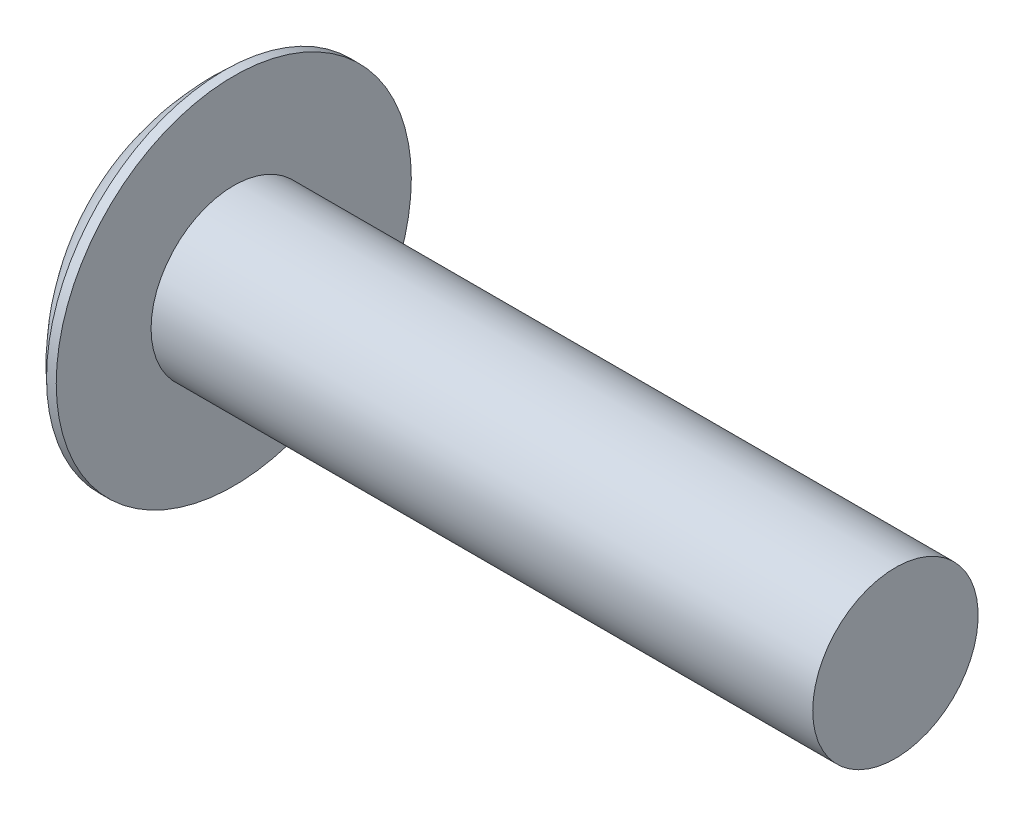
ISO-10303-21;
HEADER;
FILE_DESCRIPTION(('STEP AP214'),'2;1');
FILE_NAME('part.step','',(''),(''),'','','');
FILE_SCHEMA(('AUTOMOTIVE_DESIGN { 1 0 10303 214 1 1 1 1 }'));
ENDSEC;
DATA;
#1=APPLICATION_CONTEXT('core data for automotive mechanical design processes');
#2=APPLICATION_PROTOCOL_DEFINITION('international standard','automotive_design',2000,#1);
#3=PRODUCT_CONTEXT('',#1,'mechanical');
#4=PRODUCT('Part','Part','',(#3));
#5=PRODUCT_RELATED_PRODUCT_CATEGORY('part','',(#4));
#6=PRODUCT_DEFINITION_FORMATION('','',#4);
#7=PRODUCT_DEFINITION_CONTEXT('part definition',#1,'design');
#8=PRODUCT_DEFINITION('design','',#6,#7);
#9=PRODUCT_DEFINITION_SHAPE('','',#8);
#10=(LENGTH_UNIT() NAMED_UNIT(*) SI_UNIT(.MILLI.,.METRE.));
#11=(NAMED_UNIT(*) PLANE_ANGLE_UNIT() SI_UNIT($,.RADIAN.));
#12=(NAMED_UNIT(*) SI_UNIT($,.STERADIAN.) SOLID_ANGLE_UNIT());
#13=UNCERTAINTY_MEASURE_WITH_UNIT(LENGTH_MEASURE(1.E-05),#10,'distance_accuracy_value','');
#14=(GEOMETRIC_REPRESENTATION_CONTEXT(3) GLOBAL_UNCERTAINTY_ASSIGNED_CONTEXT((#13)) GLOBAL_UNIT_ASSIGNED_CONTEXT((#10,
#11,#12)) REPRESENTATION_CONTEXT('',''));
#15=CARTESIAN_POINT('',(0.,0.,0.));
#16=DIRECTION('',(0.,0.,1.));
#17=DIRECTION('',(1.,0.,0.));
#18=AXIS2_PLACEMENT_3D('',#15,#16,#17);
#19=CARTESIAN_POINT('',(13.6652,0.,0.));
#20=DIRECTION('',(-1.,0.,0.));
#21=DIRECTION('',(0.,1.,0.));
#22=AXIS2_PLACEMENT_3D('',#19,#20,#21);
#23=SPHERICAL_SURFACE('',#22,13.6652);
#24=CARTESIAN_POINT('',(4.59780021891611,0.,0.));
#25=DIRECTION('',(-1.,0.,0.));
#26=DIRECTION('',(0.,0.,1.));
#27=AXIS2_PLACEMENT_3D('',#24,#25,#26);
#28=CIRCLE('',#27,10.2235);
#29=CARTESIAN_POINT('',(4.59780021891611,0.,10.2235));
#30=VERTEX_POINT('',#29);
#31=EDGE_CURVE('E273',#30,#30,#28,.T.);
#32=ORIENTED_EDGE('',*,*,#31,.T.);
#33=EDGE_LOOP('',(#32));
#34=FACE_BOUND('',#33,.T.);
#35=CARTESIAN_POINT('',(13.6853681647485,0.294413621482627,0.));
#36=DIRECTION('',(-0.0683426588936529,-0.997661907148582,0.));
#37=DIRECTION('',(0.997661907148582,-0.0683426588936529,0.));
#38=AXIS2_PLACEMENT_3D('',#35,#36,#37);
#39=CIRCLE('',#38,13.6620132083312);
#40=CARTESIAN_POINT('',(1.5743937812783,1.12404957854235,6.26790304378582));
#41=VERTEX_POINT('',#40);
#42=CARTESIAN_POINT('',(0.110141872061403,1.22435497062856,1.22435497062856));
#43=VERTEX_POINT('',#42);
#44=EDGE_CURVE('E358',#41,#43,#39,.T.);
#45=ORIENTED_EDGE('',*,*,#44,.F.);
#46=CARTESIAN_POINT('',(12.2452923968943,0.,-1.8633819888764));
#47=DIRECTION('',(0.606093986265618,0.,0.795393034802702));
#48=DIRECTION('',(0.795393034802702,0.,-0.606093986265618));
#49=AXIS2_PLACEMENT_3D('',#46,#47,#48);
#50=CIRCLE('',#49,13.4628882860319);
#51=CARTESIAN_POINT('',(1.57312856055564,1.1049,6.26886714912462));
#52=VERTEX_POINT('',#51);
#53=EDGE_CURVE('E243',#41,#52,#50,.T.);
#54=ORIENTED_EDGE('',*,*,#53,.T.);
#55=CARTESIAN_POINT('',(13.6652,1.1049,0.));
#56=DIRECTION('',(0.,1.,0.));
#57=DIRECTION('',(0.,0.,1.));
#58=AXIS2_PLACEMENT_3D('',#55,#56,#57);
#59=CIRCLE('',#58,13.620458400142);
#60=CARTESIAN_POINT('',(2.8448,1.1049,8.27259517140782));
#61=VERTEX_POINT('',#60);
#62=EDGE_CURVE('E290',#52,#61,#59,.T.);
#63=ORIENTED_EDGE('',*,*,#62,.T.);
#64=CARTESIAN_POINT('',(2.8448,0.,0.));
#65=DIRECTION('',(-1.,0.,0.));
#66=DIRECTION('',(0.,0.,1.));
#67=AXIS2_PLACEMENT_3D('',#64,#65,#66);
#68=CIRCLE('',#67,8.34605504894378);
#69=CARTESIAN_POINT('',(2.8448,-1.1049,8.27259517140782));
#70=VERTEX_POINT('',#69);
#71=EDGE_CURVE('E282',#70,#61,#68,.T.);
#72=ORIENTED_EDGE('',*,*,#71,.F.);
#73=CARTESIAN_POINT('',(13.6652,-1.1049,0.));
#74=DIRECTION('',(0.,-1.,0.));
#75=DIRECTION('',(0.,0.,-1.));
#76=AXIS2_PLACEMENT_3D('',#73,#74,#75);
#77=CIRCLE('',#76,13.620458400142);
#78=CARTESIAN_POINT('',(1.57312856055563,-1.1049,6.26886714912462));
#79=VERTEX_POINT('',#78);
#80=EDGE_CURVE('E287',#70,#79,#77,.T.);
#81=ORIENTED_EDGE('',*,*,#80,.T.);
#82=CARTESIAN_POINT('',(1.5743937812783,-1.1240495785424,6.26790304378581));
#83=VERTEX_POINT('',#82);
#84=EDGE_CURVE('E375',#79,#83,#50,.T.);
#85=ORIENTED_EDGE('',*,*,#84,.T.);
#86=CARTESIAN_POINT('',(13.6853681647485,-0.294413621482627,0.));
#87=DIRECTION('',(-0.068342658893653,0.997661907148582,0.));
#88=DIRECTION('',(-0.997661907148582,-0.068342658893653,0.));
#89=AXIS2_PLACEMENT_3D('',#86,#87,#88);
#90=CIRCLE('',#89,13.6620132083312);
#91=CARTESIAN_POINT('',(0.110141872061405,-1.22435497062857,1.22435497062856));
#92=VERTEX_POINT('',#91);
#93=EDGE_CURVE('E305',#92,#83,#90,.T.);
#94=ORIENTED_EDGE('',*,*,#93,.F.);
#95=CARTESIAN_POINT('',(13.6853681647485,0.,0.294413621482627));
#96=DIRECTION('',(-0.068342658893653,0.,-0.997661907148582));
#97=DIRECTION('',(-0.997661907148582,0.,0.068342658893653));
#98=AXIS2_PLACEMENT_3D('',#95,#96,#97);
#99=CIRCLE('',#98,13.6620132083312);
#100=CARTESIAN_POINT('',(1.57439378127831,-6.26790304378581,1.12404957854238));
#101=VERTEX_POINT('',#100);
#102=EDGE_CURVE('E250',#101,#92,#99,.T.);
#103=ORIENTED_EDGE('',*,*,#102,.F.);
#104=CARTESIAN_POINT('',(12.2452923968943,1.8633819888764,0.));
#105=DIRECTION('',(0.606093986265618,-0.795393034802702,0.));
#106=DIRECTION('',(0.795393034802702,0.606093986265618,0.));
#107=AXIS2_PLACEMENT_3D('',#104,#105,#106);
#108=CIRCLE('',#107,13.4628882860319);
#109=CARTESIAN_POINT('',(1.57439378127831,-6.26790304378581,-1.12404957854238));
#110=VERTEX_POINT('',#109);
#111=EDGE_CURVE('E47',#101,#110,#108,.T.);
#112=ORIENTED_EDGE('',*,*,#111,.T.);
#113=CARTESIAN_POINT('',(13.6853681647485,0.,-0.294413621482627));
#114=DIRECTION('',(-0.0683426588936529,0.,0.997661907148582));
#115=DIRECTION('',(0.997661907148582,0.,0.0683426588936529));
#116=AXIS2_PLACEMENT_3D('',#113,#114,#115);
#117=CIRCLE('',#116,13.6620132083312);
#118=CARTESIAN_POINT('',(0.110141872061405,-1.22435497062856,-1.22435497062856));
#119=VERTEX_POINT('',#118);
#120=EDGE_CURVE('E259',#119,#110,#117,.T.);
#121=ORIENTED_EDGE('',*,*,#120,.F.);
#122=CARTESIAN_POINT('',(1.5743937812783,-1.12404957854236,-6.26790304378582));
#123=VERTEX_POINT('',#122);
#124=EDGE_CURVE('E54',#123,#119,#90,.T.);
#125=ORIENTED_EDGE('',*,*,#124,.F.);
#126=CARTESIAN_POINT('',(12.2452923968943,0.,1.8633819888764));
#127=DIRECTION('',(0.606093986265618,0.,-0.795393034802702));
#128=DIRECTION('',(-0.795393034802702,0.,-0.606093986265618));
#129=AXIS2_PLACEMENT_3D('',#126,#127,#128);
#130=CIRCLE('',#129,13.4628882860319);
#131=CARTESIAN_POINT('',(1.57312856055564,-1.1049,-6.26886714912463));
#132=VERTEX_POINT('',#131);
#133=EDGE_CURVE('E411',#123,#132,#130,.T.);
#134=ORIENTED_EDGE('',*,*,#133,.T.);
#135=CARTESIAN_POINT('',(2.8448,-1.1049,-8.27259517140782));
#136=VERTEX_POINT('',#135);
#137=EDGE_CURVE('E285',#132,#136,#77,.T.);
#138=ORIENTED_EDGE('',*,*,#137,.T.);
#139=CARTESIAN_POINT('',(2.8448,1.1049,-8.27259517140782));
#140=VERTEX_POINT('',#139);
#141=EDGE_CURVE('E286',#140,#136,#68,.T.);
#142=ORIENTED_EDGE('',*,*,#141,.F.);
#143=CARTESIAN_POINT('',(1.57312856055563,1.1049,-6.26886714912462));
#144=VERTEX_POINT('',#143);
#145=EDGE_CURVE('E291',#140,#144,#59,.T.);
#146=ORIENTED_EDGE('',*,*,#145,.T.);
#147=CARTESIAN_POINT('',(1.5743937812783,1.1240495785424,-6.26790304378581));
#148=VERTEX_POINT('',#147);
#149=EDGE_CURVE('E224',#144,#148,#130,.T.);
#150=ORIENTED_EDGE('',*,*,#149,.T.);
#151=CARTESIAN_POINT('',(0.110141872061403,1.22435497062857,-1.22435497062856));
#152=VERTEX_POINT('',#151);
#153=EDGE_CURVE('E360',#152,#148,#39,.T.);
#154=ORIENTED_EDGE('',*,*,#153,.F.);
#155=CARTESIAN_POINT('',(1.5743937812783,6.26790304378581,-1.12404957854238));
#156=VERTEX_POINT('',#155);
#157=EDGE_CURVE('E261',#156,#152,#117,.T.);
#158=ORIENTED_EDGE('',*,*,#157,.F.);
#159=CARTESIAN_POINT('',(12.2452923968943,-1.86338198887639,0.));
#160=DIRECTION('',(0.606093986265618,0.795393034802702,0.));
#161=DIRECTION('',(-0.795393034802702,0.606093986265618,0.));
#162=AXIS2_PLACEMENT_3D('',#159,#160,#161);
#163=CIRCLE('',#162,13.4628882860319);
#164=CARTESIAN_POINT('',(1.5743937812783,6.26790304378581,1.12404957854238));
#165=VERTEX_POINT('',#164);
#166=EDGE_CURVE('E11',#156,#165,#163,.T.);
#167=ORIENTED_EDGE('',*,*,#166,.T.);
#168=EDGE_CURVE('E252',#43,#165,#99,.T.);
#169=ORIENTED_EDGE('',*,*,#168,.F.);
#170=EDGE_LOOP('',(#45,#54,#63,#72,#81,#85,#94,#103,#112,#121,#125,#134,#138,#142,#146,#150,
#154,#158,#167,#169));
#171=FACE_BOUND('',#170,.T.);
#172=ADVANCED_FACE('F39',(#34,#171),#23,.T.);
#173=CARTESIAN_POINT('',(2.8448,1.1049,10.2235));
#174=DIRECTION('',(0.,1.,0.));
#175=DIRECTION('',(0.,0.,1.));
#176=AXIS2_PLACEMENT_3D('',#173,#174,#175);
#177=PLANE('',#176);
#178=DIRECTION('',(0.,0.,1.));
#179=VECTOR('',#178,1.);
#180=CARTESIAN_POINT('',(1.85393814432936,1.1049,10.2234999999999));
#181=LINE('',#180,#179);
#182=CARTESIAN_POINT('',(1.85393814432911,1.10490000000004,-6.0548886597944));
#183=VERTEX_POINT('',#182);
#184=CARTESIAN_POINT('',(1.85393814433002,1.1049,-1.10489999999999));
#185=VERTEX_POINT('',#184);
#186=EDGE_CURVE('E62',#183,#185,#181,.T.);
#187=ORIENTED_EDGE('',*,*,#186,.F.);
#188=DIRECTION('',(-0.795393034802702,0.,-0.606093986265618));
#189=VECTOR('',#188,1.);
#190=CARTESIAN_POINT('',(10.3283403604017,1.1049,0.40265370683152));
#191=LINE('',#190,#189);
#192=EDGE_CURVE('E407',#183,#144,#191,.T.);
#193=ORIENTED_EDGE('',*,*,#192,.T.);
#194=ORIENTED_EDGE('',*,*,#145,.F.);
#195=DIRECTION('',(0.,0.,-1.));
#196=VECTOR('',#195,1.);
#197=CARTESIAN_POINT('',(2.8448,1.1049,10.2235));
#198=LINE('',#197,#196);
#199=CARTESIAN_POINT('',(2.8448,1.1049,-1.03702316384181));
#200=VERTEX_POINT('',#199);
#201=EDGE_CURVE('E266',#200,#140,#198,.T.);
#202=ORIENTED_EDGE('',*,*,#201,.F.);
#203=DIRECTION('',(0.997661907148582,0.,0.0683426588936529));
#204=VECTOR('',#203,1.);
#205=CARTESIAN_POINT('',(3.61257475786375,1.1049,-0.984428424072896));
#206=LINE('',#205,#204);
#207=EDGE_CURVE('E256',#185,#200,#206,.T.);
#208=ORIENTED_EDGE('',*,*,#207,.F.);
#209=EDGE_LOOP('',(#187,#193,#194,#202,#208));
#210=FACE_BOUND('',#209,.T.);
#211=ADVANCED_FACE('F405',(#210),#177,.F.);
#212=CARTESIAN_POINT('',(2.8448,-1.1049,-10.2235));
#213=DIRECTION('',(0.,-1.,0.));
#214=DIRECTION('',(0.,0.,-1.));
#215=AXIS2_PLACEMENT_3D('',#212,#213,#214);
#216=PLANE('',#215);
#217=DIRECTION('',(0.,0.,-1.));
#218=VECTOR('',#217,1.);
#219=CARTESIAN_POINT('',(1.85393814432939,-1.1049,-10.2234999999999));
#220=LINE('',#219,#218);
#221=CARTESIAN_POINT('',(1.85393814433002,-1.10489999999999,-1.10489999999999));
#222=VERTEX_POINT('',#221);
#223=CARTESIAN_POINT('',(1.85393814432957,-1.1049,-6.05488865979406));
#224=VERTEX_POINT('',#223);
#225=EDGE_CURVE('E334',#222,#224,#220,.T.);
#226=ORIENTED_EDGE('',*,*,#225,.F.);
#227=DIRECTION('',(-0.997661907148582,0.,-0.0683426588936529));
#228=VECTOR('',#227,1.);
#229=CARTESIAN_POINT('',(2.2184396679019,-1.1049,-1.07993061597));
#230=LINE('',#229,#228);
#231=CARTESIAN_POINT('',(2.8448,-1.1049,-1.03702316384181));
#232=VERTEX_POINT('',#231);
#233=EDGE_CURVE('E253',#232,#222,#230,.T.);
#234=ORIENTED_EDGE('',*,*,#233,.F.);
#235=DIRECTION('',(0.,0.,1.));
#236=VECTOR('',#235,1.);
#237=CARTESIAN_POINT('',(2.8448,-1.1049,-10.2235));
#238=LINE('',#237,#236);
#239=EDGE_CURVE('E267',#136,#232,#238,.T.);
#240=ORIENTED_EDGE('',*,*,#239,.F.);
#241=ORIENTED_EDGE('',*,*,#137,.F.);
#242=DIRECTION('',(0.795393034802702,0.,0.606093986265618));
#243=VECTOR('',#242,1.);
#244=CARTESIAN_POINT('',(0.471190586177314,-1.1049,-7.10855011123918));
#245=LINE('',#244,#243);
#246=EDGE_CURVE('E415',#132,#224,#245,.T.);
#247=ORIENTED_EDGE('',*,*,#246,.T.);
#248=EDGE_LOOP('',(#226,#234,#240,#241,#247));
#249=FACE_BOUND('',#248,.T.);
#250=ADVANCED_FACE('F332',(#249),#216,.F.);
#251=CARTESIAN_POINT('',(2.8448,1.1049,-10.2235));
#252=DIRECTION('',(-1.,0.,0.));
#253=DIRECTION('',(0.,0.,1.));
#254=AXIS2_PLACEMENT_3D('',#251,#252,#253);
#255=PLANE('',#254);
#256=DIRECTION('',(0.,-1.,0.));
#257=VECTOR('',#256,1.);
#258=CARTESIAN_POINT('',(2.8448,1.10489999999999,-5.29984632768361));
#259=LINE('',#258,#257);
#260=CARTESIAN_POINT('',(2.8448,1.03702316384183,-5.29984632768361));
#261=VERTEX_POINT('',#260);
#262=CARTESIAN_POINT('',(2.8448,-1.03702316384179,-5.29984632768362));
#263=VERTEX_POINT('',#262);
#264=EDGE_CURVE('E345',#261,#263,#259,.T.);
#265=ORIENTED_EDGE('',*,*,#264,.F.);
#266=DIRECTION('',(0.,0.,1.));
#267=VECTOR('',#266,1.);
#268=CARTESIAN_POINT('',(2.8448,1.03702316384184,-10.2235));
#269=LINE('',#268,#267);
#270=CARTESIAN_POINT('',(2.8448,1.03702316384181,-1.03702316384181));
#271=VERTEX_POINT('',#270);
#272=EDGE_CURVE('E367',#261,#271,#269,.T.);
#273=ORIENTED_EDGE('',*,*,#272,.T.);
#274=DIRECTION('',(0.,1.,0.));
#275=VECTOR('',#274,1.);
#276=CARTESIAN_POINT('',(2.8448,1.1049,-1.03702316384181));
#277=LINE('',#276,#275);
#278=EDGE_CURVE('E297',#271,#200,#277,.T.);
#279=ORIENTED_EDGE('',*,*,#278,.T.);
#280=ORIENTED_EDGE('',*,*,#201,.T.);
#281=ORIENTED_EDGE('',*,*,#141,.T.);
#282=ORIENTED_EDGE('',*,*,#239,.T.);
#283=CARTESIAN_POINT('',(2.8448,-1.03702316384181,-1.03702316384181));
#284=VERTEX_POINT('',#283);
#285=EDGE_CURVE('E298',#232,#284,#277,.T.);
#286=ORIENTED_EDGE('',*,*,#285,.T.);
#287=DIRECTION('',(0.,0.,-1.));
#288=VECTOR('',#287,1.);
#289=CARTESIAN_POINT('',(2.8448,-1.03702316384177,-10.2235));
#290=LINE('',#289,#288);
#291=EDGE_CURVE('E343',#284,#263,#290,.T.);
#292=ORIENTED_EDGE('',*,*,#291,.T.);
#293=EDGE_LOOP('',(#265,#273,#279,#280,#281,#282,#286,#292));
#294=FACE_BOUND('',#293,.T.);
#295=ADVANCED_FACE('F325',(#294),#255,.T.);
#296=DIRECTION('',(0.,-1.,0.));
#297=VECTOR('',#296,1.);
#298=CARTESIAN_POINT('',(2.8448,1.1049,1.03702316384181));
#299=LINE('',#298,#297);
#300=CARTESIAN_POINT('',(2.8448,1.1049,1.03702316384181));
#301=VERTEX_POINT('',#300);
#302=CARTESIAN_POINT('',(2.8448,1.0370231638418,1.03702316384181));
#303=VERTEX_POINT('',#302);
#304=EDGE_CURVE('E294',#301,#303,#299,.T.);
#305=ORIENTED_EDGE('',*,*,#304,.T.);
#306=DIRECTION('',(0.,0.,1.));
#307=VECTOR('',#306,1.);
#308=CARTESIAN_POINT('',(2.8448,1.03702316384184,-10.2235));
#309=LINE('',#308,#307);
#310=CARTESIAN_POINT('',(2.8448,1.03702316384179,5.29984632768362));
#311=VERTEX_POINT('',#310);
#312=EDGE_CURVE('E361',#303,#311,#309,.T.);
#313=ORIENTED_EDGE('',*,*,#312,.T.);
#314=DIRECTION('',(0.,1.,0.));
#315=VECTOR('',#314,1.);
#316=CARTESIAN_POINT('',(2.8448,1.10489999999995,5.29984632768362));
#317=LINE('',#316,#315);
#318=CARTESIAN_POINT('',(2.8448,-1.03702316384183,5.29984632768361));
#319=VERTEX_POINT('',#318);
#320=EDGE_CURVE('E371',#319,#311,#317,.T.);
#321=ORIENTED_EDGE('',*,*,#320,.F.);
#322=DIRECTION('',(0.,0.,-1.));
#323=VECTOR('',#322,1.);
#324=CARTESIAN_POINT('',(2.8448,-1.03702316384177,-10.2235));
#325=LINE('',#324,#323);
#326=CARTESIAN_POINT('',(2.8448,-1.03702316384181,1.03702316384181));
#327=VERTEX_POINT('',#326);
#328=EDGE_CURVE('E195',#319,#327,#325,.T.);
#329=ORIENTED_EDGE('',*,*,#328,.T.);
#330=CARTESIAN_POINT('',(2.8448,-1.1049,1.03702316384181));
#331=VERTEX_POINT('',#330);
#332=EDGE_CURVE('E223',#327,#331,#299,.T.);
#333=ORIENTED_EDGE('',*,*,#332,.T.);
#334=EDGE_CURVE('E265',#331,#70,#238,.T.);
#335=ORIENTED_EDGE('',*,*,#334,.T.);
#336=ORIENTED_EDGE('',*,*,#71,.T.);
#337=EDGE_CURVE('E262',#61,#301,#198,.T.);
#338=ORIENTED_EDGE('',*,*,#337,.T.);
#339=EDGE_LOOP('',(#305,#313,#321,#329,#333,#335,#336,#338));
#340=FACE_BOUND('',#339,.T.);
#341=ADVANCED_FACE('F318',(#340),#255,.T.);
#342=CARTESIAN_POINT('',(9.79992734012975,0.,-0.560577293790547));
#343=DIRECTION('',(-0.0683426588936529,0.,0.997661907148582));
#344=DIRECTION('',(0.997661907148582,0.,0.0683426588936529));
#345=AXIS2_PLACEMENT_3D('',#342,#343,#344);
#346=PLANE('',#345);
#347=ORIENTED_EDGE('',*,*,#157,.T.);
#348=DIRECTION('',(0.995340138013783,-0.0681836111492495,0.0681836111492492));
#349=VECTOR('',#348,1.);
#350=CARTESIAN_POINT('',(9.83797141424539,0.557971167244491,-0.557971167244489));
#351=LINE('',#350,#349);
#352=EDGE_CURVE('E368',#152,#185,#351,.T.);
#353=ORIENTED_EDGE('',*,*,#352,.T.);
#354=ORIENTED_EDGE('',*,*,#207,.T.);
#355=ORIENTED_EDGE('',*,*,#278,.F.);
#356=CARTESIAN_POINT('',(8.9916,0.615950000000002,-0.615949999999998));
#357=VERTEX_POINT('',#356);
#358=EDGE_CURVE('E364',#271,#357,#351,.T.);
#359=ORIENTED_EDGE('',*,*,#358,.T.);
#360=DIRECTION('',(0.794214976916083,-0.60519629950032,0.0544059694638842));
#361=VECTOR('',#360,1.);
#362=CARTESIAN_POINT('',(0.,7.4676,-1.2319));
#363=LINE('',#362,#361);
#364=EDGE_CURVE('E247',#156,#357,#363,.T.);
#365=ORIENTED_EDGE('',*,*,#364,.F.);
#366=EDGE_LOOP('',(#347,#353,#354,#355,#359,#365));
#367=FACE_BOUND('',#366,.T.);
#368=ADVANCED_FACE('F397',(#367),#346,.T.);
#369=DIRECTION('',(0.794214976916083,0.60519629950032,0.0544059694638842));
#370=VECTOR('',#369,1.);
#371=CARTESIAN_POINT('',(0.,-7.4676,-1.2319));
#372=LINE('',#371,#370);
#373=CARTESIAN_POINT('',(8.9916,-0.61595,-0.61595));
#374=VERTEX_POINT('',#373);
#375=EDGE_CURVE('E233',#110,#374,#372,.T.);
#376=ORIENTED_EDGE('',*,*,#375,.T.);
#377=DIRECTION('',(-0.995340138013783,-0.0681836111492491,-0.0681836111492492));
#378=VECTOR('',#377,1.);
#379=CARTESIAN_POINT('',(9.83797141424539,-0.557971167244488,-0.557971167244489));
#380=LINE('',#379,#378);
#381=EDGE_CURVE('E341',#374,#284,#380,.T.);
#382=ORIENTED_EDGE('',*,*,#381,.T.);
#383=ORIENTED_EDGE('',*,*,#285,.F.);
#384=ORIENTED_EDGE('',*,*,#233,.T.);
#385=EDGE_CURVE('E338',#222,#119,#380,.T.);
#386=ORIENTED_EDGE('',*,*,#385,.T.);
#387=ORIENTED_EDGE('',*,*,#120,.T.);
#388=EDGE_LOOP('',(#376,#382,#383,#384,#386,#387));
#389=FACE_BOUND('',#388,.T.);
#390=ADVANCED_FACE('F337',(#389),#346,.T.);
#391=CARTESIAN_POINT('',(9.79992734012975,0.,0.560577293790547));
#392=DIRECTION('',(-0.068342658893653,0.,-0.997661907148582));
#393=DIRECTION('',(-0.997661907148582,0.,0.068342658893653));
#394=AXIS2_PLACEMENT_3D('',#391,#392,#393);
#395=PLANE('',#394);
#396=DIRECTION('',(0.794214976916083,-0.60519629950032,-0.0544059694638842));
#397=VECTOR('',#396,1.);
#398=CARTESIAN_POINT('',(0.,7.4676,1.2319));
#399=LINE('',#398,#397);
#400=CARTESIAN_POINT('',(8.9916,0.615949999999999,0.61595));
#401=VERTEX_POINT('',#400);
#402=EDGE_CURVE('E382',#165,#401,#399,.T.);
#403=ORIENTED_EDGE('',*,*,#402,.T.);
#404=DIRECTION('',(-0.995340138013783,0.068183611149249,0.0681836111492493));
#405=VECTOR('',#404,1.);
#406=CARTESIAN_POINT('',(9.83797141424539,0.557971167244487,0.55797116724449));
#407=LINE('',#406,#405);
#408=EDGE_CURVE('E353',#401,#303,#407,.T.);
#409=ORIENTED_EDGE('',*,*,#408,.T.);
#410=ORIENTED_EDGE('',*,*,#304,.F.);
#411=DIRECTION('',(-0.997661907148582,0.,0.068342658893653));
#412=VECTOR('',#411,1.);
#413=CARTESIAN_POINT('',(2.2184396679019,1.1049,1.07993061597));
#414=LINE('',#413,#412);
#415=CARTESIAN_POINT('',(1.85393814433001,1.10489999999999,1.10489999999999));
#416=VERTEX_POINT('',#415);
#417=EDGE_CURVE('E246',#301,#416,#414,.T.);
#418=ORIENTED_EDGE('',*,*,#417,.T.);
#419=EDGE_CURVE('E348',#416,#43,#407,.T.);
#420=ORIENTED_EDGE('',*,*,#419,.T.);
#421=ORIENTED_EDGE('',*,*,#168,.T.);
#422=EDGE_LOOP('',(#403,#409,#410,#418,#420,#421));
#423=FACE_BOUND('',#422,.T.);
#424=ADVANCED_FACE('F387',(#423),#395,.T.);
#425=ORIENTED_EDGE('',*,*,#102,.T.);
#426=DIRECTION('',(0.995340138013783,0.0681836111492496,-0.0681836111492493));
#427=VECTOR('',#426,1.);
#428=CARTESIAN_POINT('',(9.83797141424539,-0.557971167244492,0.55797116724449));
#429=LINE('',#428,#427);
#430=CARTESIAN_POINT('',(1.85393814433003,-1.1049,1.10489999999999));
#431=VERTEX_POINT('',#430);
#432=EDGE_CURVE('E226',#92,#431,#429,.T.);
#433=ORIENTED_EDGE('',*,*,#432,.T.);
#434=DIRECTION('',(0.997661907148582,0.,-0.068342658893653));
#435=VECTOR('',#434,1.);
#436=CARTESIAN_POINT('',(3.61257475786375,-1.1049,0.984428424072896));
#437=LINE('',#436,#435);
#438=EDGE_CURVE('E244',#431,#331,#437,.T.);
#439=ORIENTED_EDGE('',*,*,#438,.T.);
#440=ORIENTED_EDGE('',*,*,#332,.F.);
#441=CARTESIAN_POINT('',(8.9916,-0.615950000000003,0.615949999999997));
#442=VERTEX_POINT('',#441);
#443=EDGE_CURVE('E193',#327,#442,#429,.T.);
#444=ORIENTED_EDGE('',*,*,#443,.T.);
#445=DIRECTION('',(0.794214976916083,0.60519629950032,-0.0544059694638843));
#446=VECTOR('',#445,1.);
#447=CARTESIAN_POINT('',(0.,-7.4676,1.2319));
#448=LINE('',#447,#446);
#449=EDGE_CURVE('E220',#101,#442,#448,.T.);
#450=ORIENTED_EDGE('',*,*,#449,.F.);
#451=EDGE_LOOP('',(#425,#433,#439,#440,#444,#450));
#452=FACE_BOUND('',#451,.T.);
#453=ADVANCED_FACE('F219',(#452),#395,.T.);
#454=ORIENTED_EDGE('',*,*,#62,.F.);
#455=DIRECTION('',(0.795393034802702,0.,-0.606093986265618));
#456=VECTOR('',#455,1.);
#457=CARTESIAN_POINT('',(0.471190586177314,1.1049,7.10855011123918));
#458=LINE('',#457,#456);
#459=CARTESIAN_POINT('',(1.85393814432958,1.1049,6.05488865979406));
#460=VERTEX_POINT('',#459);
#461=EDGE_CURVE('E377',#52,#460,#458,.T.);
#462=ORIENTED_EDGE('',*,*,#461,.T.);
#463=DIRECTION('',(0.,0.,1.));
#464=VECTOR('',#463,1.);
#465=CARTESIAN_POINT('',(1.85393814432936,1.1049,10.2234999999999));
#466=LINE('',#465,#464);
#467=EDGE_CURVE('E351',#416,#460,#466,.T.);
#468=ORIENTED_EDGE('',*,*,#467,.F.);
#469=ORIENTED_EDGE('',*,*,#417,.F.);
#470=ORIENTED_EDGE('',*,*,#337,.F.);
#471=EDGE_LOOP('',(#454,#462,#468,#469,#470));
#472=FACE_BOUND('',#471,.T.);
#473=ADVANCED_FACE('F432',(#472),#177,.F.);
#474=DIRECTION('',(0.,0.,-1.));
#475=VECTOR('',#474,1.);
#476=CARTESIAN_POINT('',(1.85393814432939,-1.1049,-10.2234999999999));
#477=LINE('',#476,#475);
#478=CARTESIAN_POINT('',(1.85393814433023,-1.1049,6.05488865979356));
#479=VERTEX_POINT('',#478);
#480=EDGE_CURVE('E310',#479,#431,#477,.T.);
#481=ORIENTED_EDGE('',*,*,#480,.F.);
#482=DIRECTION('',(-0.795393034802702,0.,0.606093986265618));
#483=VECTOR('',#482,1.);
#484=CARTESIAN_POINT('',(10.3283403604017,-1.1049,-0.402653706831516));
#485=LINE('',#484,#483);
#486=EDGE_CURVE('E373',#479,#79,#485,.T.);
#487=ORIENTED_EDGE('',*,*,#486,.T.);
#488=ORIENTED_EDGE('',*,*,#80,.F.);
#489=ORIENTED_EDGE('',*,*,#334,.F.);
#490=ORIENTED_EDGE('',*,*,#438,.F.);
#491=EDGE_LOOP('',(#481,#487,#488,#489,#490));
#492=FACE_BOUND('',#491,.T.);
#493=ADVANCED_FACE('F313',(#492),#216,.F.);
#494=CARTESIAN_POINT('',(-25.4,0.,0.));
#495=DIRECTION('',(-1.,0.,0.));
#496=DIRECTION('',(0.,0.,1.));
#497=AXIS2_PLACEMENT_3D('',#494,#495,#496);
#498=CYLINDRICAL_SURFACE('',#497,4.7625);
#499=CARTESIAN_POINT('',(43.2562,0.,0.));
#500=DIRECTION('',(-1.,0.,0.));
#501=DIRECTION('',(0.,0.,1.));
#502=AXIS2_PLACEMENT_3D('',#499,#500,#501);
#503=CIRCLE('',#502,4.7625);
#504=CARTESIAN_POINT('',(43.2562,0.,4.7625));
#505=VERTEX_POINT('',#504);
#506=EDGE_CURVE('E270',#505,#505,#503,.T.);
#507=ORIENTED_EDGE('',*,*,#506,.T.);
#508=EDGE_LOOP('',(#507));
#509=FACE_BOUND('',#508,.T.);
#510=CARTESIAN_POINT('',(5.1562,0.,0.));
#511=DIRECTION('',(-1.,0.,0.));
#512=DIRECTION('',(0.,0.,1.));
#513=AXIS2_PLACEMENT_3D('',#510,#511,#512);
#514=CIRCLE('',#513,4.7625);
#515=CARTESIAN_POINT('',(5.1562,0.,4.7625));
#516=VERTEX_POINT('',#515);
#517=EDGE_CURVE('E279',#516,#516,#514,.T.);
#518=ORIENTED_EDGE('',*,*,#517,.F.);
#519=EDGE_LOOP('',(#518));
#520=FACE_BOUND('',#519,.T.);
#521=ADVANCED_FACE('F41',(#509,#520),#498,.T.);
#522=CARTESIAN_POINT('',(5.1562,4.7625,0.));
#523=DIRECTION('',(-1.,0.,0.));
#524=DIRECTION('',(0.,0.,1.));
#525=AXIS2_PLACEMENT_3D('',#522,#523,#524);
#526=PLANE('',#525);
#527=CARTESIAN_POINT('',(5.1562,0.,0.));
#528=DIRECTION('',(-1.,0.,0.));
#529=DIRECTION('',(0.,0.,1.));
#530=AXIS2_PLACEMENT_3D('',#527,#528,#529);
#531=CIRCLE('',#530,10.2235);
#532=CARTESIAN_POINT('',(5.1562,0.,10.2235));
#533=VERTEX_POINT('',#532);
#534=EDGE_CURVE('E276',#533,#533,#531,.T.);
#535=ORIENTED_EDGE('',*,*,#534,.F.);
#536=EDGE_LOOP('',(#535));
#537=FACE_BOUND('',#536,.T.);
#538=ORIENTED_EDGE('',*,*,#517,.T.);
#539=EDGE_LOOP('',(#538));
#540=FACE_BOUND('',#539,.T.);
#541=ADVANCED_FACE('F466',(#537,#540),#526,.F.);
#542=CARTESIAN_POINT('',(-25.4,0.,0.));
#543=DIRECTION('',(-1.,0.,0.));
#544=DIRECTION('',(0.,0.,1.));
#545=AXIS2_PLACEMENT_3D('',#542,#543,#544);
#546=CYLINDRICAL_SURFACE('',#545,10.2235);
#547=ORIENTED_EDGE('',*,*,#534,.T.);
#548=EDGE_LOOP('',(#547));
#549=FACE_BOUND('',#548,.T.);
#550=ORIENTED_EDGE('',*,*,#31,.F.);
#551=EDGE_LOOP('',(#550));
#552=FACE_BOUND('',#551,.T.);
#553=ADVANCED_FACE('F464',(#549,#552),#546,.T.);
#554=CARTESIAN_POINT('',(43.2562,4.7625,0.));
#555=DIRECTION('',(1.,0.,0.));
#556=DIRECTION('',(0.,0.,-1.));
#557=AXIS2_PLACEMENT_3D('',#554,#555,#556);
#558=PLANE('',#557);
#559=ORIENTED_EDGE('',*,*,#506,.F.);
#560=EDGE_LOOP('',(#559));
#561=FACE_BOUND('',#560,.T.);
#562=ADVANCED_FACE('F463',(#561),#558,.T.);
#563=CARTESIAN_POINT('',(8.9916,0.61595,0.61595));
#564=DIRECTION('',(0.606093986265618,0.795393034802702,0.));
#565=DIRECTION('',(-0.795393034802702,0.606093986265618,0.));
#566=AXIS2_PLACEMENT_3D('',#563,#564,#565);
#567=PLANE('',#566);
#568=ORIENTED_EDGE('',*,*,#364,.T.);
#569=DIRECTION('',(0.,0.,-1.));
#570=VECTOR('',#569,1.);
#571=CARTESIAN_POINT('',(8.9916,0.61595,0.615950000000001));
#572=LINE('',#571,#570);
#573=EDGE_CURVE('E212',#401,#357,#572,.T.);
#574=ORIENTED_EDGE('',*,*,#573,.F.);
#575=ORIENTED_EDGE('',*,*,#402,.F.);
#576=ORIENTED_EDGE('',*,*,#166,.F.);
#577=EDGE_LOOP('',(#568,#574,#575,#576));
#578=FACE_BOUND('',#577,.T.);
#579=ADVANCED_FACE('F390',(#578),#567,.F.);
#580=CARTESIAN_POINT('',(8.9916,-0.61595,-0.61595));
#581=DIRECTION('',(0.606093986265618,-0.795393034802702,0.));
#582=DIRECTION('',(0.795393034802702,0.606093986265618,0.));
#583=AXIS2_PLACEMENT_3D('',#580,#581,#582);
#584=PLANE('',#583);
#585=ORIENTED_EDGE('',*,*,#449,.T.);
#586=DIRECTION('',(0.,0.,1.));
#587=VECTOR('',#586,1.);
#588=CARTESIAN_POINT('',(8.9916,-0.61595,-0.61595));
#589=LINE('',#588,#587);
#590=EDGE_CURVE('E211',#374,#442,#589,.T.);
#591=ORIENTED_EDGE('',*,*,#590,.F.);
#592=ORIENTED_EDGE('',*,*,#375,.F.);
#593=ORIENTED_EDGE('',*,*,#111,.F.);
#594=EDGE_LOOP('',(#585,#591,#592,#593));
#595=FACE_BOUND('',#594,.T.);
#596=ADVANCED_FACE('F229',(#595),#584,.F.);
#597=CARTESIAN_POINT('',(8.9916,0.61595,-0.61595));
#598=DIRECTION('',(-1.,0.,0.));
#599=DIRECTION('',(0.,0.,1.));
#600=AXIS2_PLACEMENT_3D('',#597,#598,#599);
#601=PLANE('',#600);
#602=DIRECTION('',(0.,1.,0.));
#603=VECTOR('',#602,1.);
#604=CARTESIAN_POINT('',(8.9916,-0.61595,-0.61595));
#605=LINE('',#604,#603);
#606=EDGE_CURVE('E237',#374,#357,#605,.T.);
#607=ORIENTED_EDGE('',*,*,#606,.F.);
#608=ORIENTED_EDGE('',*,*,#590,.T.);
#609=DIRECTION('',(0.,-1.,0.));
#610=VECTOR('',#609,1.);
#611=CARTESIAN_POINT('',(8.9916,0.61595,0.615950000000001));
#612=LINE('',#611,#610);
#613=EDGE_CURVE('E202',#401,#442,#612,.T.);
#614=ORIENTED_EDGE('',*,*,#613,.F.);
#615=ORIENTED_EDGE('',*,*,#573,.T.);
#616=EDGE_LOOP('',(#607,#608,#614,#615));
#617=FACE_BOUND('',#616,.T.);
#618=ADVANCED_FACE('F235',(#617),#601,.T.);
#619=CARTESIAN_POINT('',(8.9916,0.615950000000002,-0.615949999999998));
#620=DIRECTION('',(0.606093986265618,0.,-0.795393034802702));
#621=DIRECTION('',(0.795393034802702,0.,0.606093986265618));
#622=AXIS2_PLACEMENT_3D('',#619,#620,#621);
#623=PLANE('',#622);
#624=ORIENTED_EDGE('',*,*,#264,.T.);
#625=DIRECTION('',(0.794214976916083,0.0544059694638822,0.60519629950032));
#626=VECTOR('',#625,1.);
#627=CARTESIAN_POINT('',(0.,-1.23189999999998,-7.4676));
#628=LINE('',#627,#626);
#629=EDGE_CURVE('E419',#263,#374,#628,.T.);
#630=ORIENTED_EDGE('',*,*,#629,.T.);
#631=ORIENTED_EDGE('',*,*,#606,.T.);
#632=DIRECTION('',(0.794214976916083,-0.0544059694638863,0.60519629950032));
#633=VECTOR('',#632,1.);
#634=CARTESIAN_POINT('',(0.,1.23190000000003,-7.4676));
#635=LINE('',#634,#633);
#636=EDGE_CURVE('E403',#261,#357,#635,.T.);
#637=ORIENTED_EDGE('',*,*,#636,.F.);
#638=EDGE_LOOP('',(#624,#630,#631,#637));
#639=FACE_BOUND('',#638,.T.);
#640=ADVANCED_FACE('F496',(#639),#623,.F.);
#641=CARTESIAN_POINT('',(9.79992734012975,-0.560577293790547,0.));
#642=DIRECTION('',(-0.068342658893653,0.997661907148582,0.));
#643=DIRECTION('',(-0.997661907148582,-0.068342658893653,0.));
#644=AXIS2_PLACEMENT_3D('',#641,#642,#643);
#645=PLANE('',#644);
#646=ORIENTED_EDGE('',*,*,#381,.F.);
#647=ORIENTED_EDGE('',*,*,#629,.F.);
#648=ORIENTED_EDGE('',*,*,#291,.F.);
#649=EDGE_LOOP('',(#646,#647,#648));
#650=FACE_BOUND('',#649,.T.);
#651=ADVANCED_FACE('F595',(#650),#645,.T.);
#652=CARTESIAN_POINT('',(9.79992734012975,0.560577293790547,0.));
#653=DIRECTION('',(-0.0683426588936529,-0.997661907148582,0.));
#654=DIRECTION('',(0.997661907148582,-0.0683426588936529,0.));
#655=AXIS2_PLACEMENT_3D('',#652,#653,#654);
#656=PLANE('',#655);
#657=ORIENTED_EDGE('',*,*,#636,.T.);
#658=ORIENTED_EDGE('',*,*,#358,.F.);
#659=ORIENTED_EDGE('',*,*,#272,.F.);
#660=EDGE_LOOP('',(#657,#658,#659));
#661=FACE_BOUND('',#660,.T.);
#662=ADVANCED_FACE('F401',(#661),#656,.T.);
#663=CARTESIAN_POINT('',(8.9916,-0.615950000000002,0.615949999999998));
#664=DIRECTION('',(0.606093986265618,0.,0.795393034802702));
#665=DIRECTION('',(-0.795393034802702,0.,0.606093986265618));
#666=AXIS2_PLACEMENT_3D('',#663,#664,#665);
#667=PLANE('',#666);
#668=ORIENTED_EDGE('',*,*,#320,.T.);
#669=DIRECTION('',(0.794214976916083,-0.0544059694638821,-0.60519629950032));
#670=VECTOR('',#669,1.);
#671=CARTESIAN_POINT('',(0.,1.23189999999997,7.4676));
#672=LINE('',#671,#670);
#673=EDGE_CURVE('E205',#311,#401,#672,.T.);
#674=ORIENTED_EDGE('',*,*,#673,.T.);
#675=ORIENTED_EDGE('',*,*,#613,.T.);
#676=DIRECTION('',(0.794214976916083,0.0544059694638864,-0.60519629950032));
#677=VECTOR('',#676,1.);
#678=CARTESIAN_POINT('',(0.,-1.23190000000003,7.4676));
#679=LINE('',#678,#677);
#680=EDGE_CURVE('E189',#319,#442,#679,.T.);
#681=ORIENTED_EDGE('',*,*,#680,.F.);
#682=EDGE_LOOP('',(#668,#674,#675,#681));
#683=FACE_BOUND('',#682,.T.);
#684=ADVANCED_FACE('F203',(#683),#667,.F.);
#685=ORIENTED_EDGE('',*,*,#680,.T.);
#686=ORIENTED_EDGE('',*,*,#443,.F.);
#687=ORIENTED_EDGE('',*,*,#328,.F.);
#688=EDGE_LOOP('',(#685,#686,#687));
#689=FACE_BOUND('',#688,.T.);
#690=ADVANCED_FACE('F191',(#689),#645,.T.);
#691=ORIENTED_EDGE('',*,*,#408,.F.);
#692=ORIENTED_EDGE('',*,*,#673,.F.);
#693=ORIENTED_EDGE('',*,*,#312,.F.);
#694=EDGE_LOOP('',(#691,#692,#693));
#695=FACE_BOUND('',#694,.T.);
#696=ADVANCED_FACE('F450',(#695),#656,.T.);
#697=ORIENTED_EDGE('',*,*,#93,.T.);
#698=EDGE_CURVE('E198',#83,#479,#679,.T.);
#699=ORIENTED_EDGE('',*,*,#698,.T.);
#700=ORIENTED_EDGE('',*,*,#480,.T.);
#701=ORIENTED_EDGE('',*,*,#432,.F.);
#702=EDGE_LOOP('',(#697,#699,#700,#701));
#703=FACE_BOUND('',#702,.T.);
#704=ADVANCED_FACE('F426',(#703),#645,.T.);
#705=ORIENTED_EDGE('',*,*,#486,.F.);
#706=ORIENTED_EDGE('',*,*,#698,.F.);
#707=ORIENTED_EDGE('',*,*,#84,.F.);
#708=EDGE_LOOP('',(#705,#706,#707));
#709=FACE_BOUND('',#708,.T.);
#710=ADVANCED_FACE('F428',(#709),#667,.F.);
#711=ORIENTED_EDGE('',*,*,#44,.T.);
#712=ORIENTED_EDGE('',*,*,#419,.F.);
#713=ORIENTED_EDGE('',*,*,#467,.T.);
#714=EDGE_CURVE('E416',#41,#460,#672,.T.);
#715=ORIENTED_EDGE('',*,*,#714,.F.);
#716=EDGE_LOOP('',(#711,#712,#713,#715));
#717=FACE_BOUND('',#716,.T.);
#718=ADVANCED_FACE('F436',(#717),#656,.T.);
#719=ORIENTED_EDGE('',*,*,#714,.T.);
#720=ORIENTED_EDGE('',*,*,#461,.F.);
#721=ORIENTED_EDGE('',*,*,#53,.F.);
#722=EDGE_LOOP('',(#719,#720,#721));
#723=FACE_BOUND('',#722,.T.);
#724=ADVANCED_FACE('F439',(#723),#667,.F.);
#725=ORIENTED_EDGE('',*,*,#124,.T.);
#726=ORIENTED_EDGE('',*,*,#385,.F.);
#727=ORIENTED_EDGE('',*,*,#225,.T.);
#728=EDGE_CURVE('E421',#123,#224,#628,.T.);
#729=ORIENTED_EDGE('',*,*,#728,.F.);
#730=EDGE_LOOP('',(#725,#726,#727,#729));
#731=FACE_BOUND('',#730,.T.);
#732=ADVANCED_FACE('F441',(#731),#645,.T.);
#733=ORIENTED_EDGE('',*,*,#728,.T.);
#734=ORIENTED_EDGE('',*,*,#246,.F.);
#735=ORIENTED_EDGE('',*,*,#133,.F.);
#736=EDGE_LOOP('',(#733,#734,#735));
#737=FACE_BOUND('',#736,.T.);
#738=ADVANCED_FACE('F447',(#737),#623,.F.);
#739=ORIENTED_EDGE('',*,*,#153,.T.);
#740=EDGE_CURVE('E199',#148,#183,#635,.T.);
#741=ORIENTED_EDGE('',*,*,#740,.T.);
#742=ORIENTED_EDGE('',*,*,#186,.T.);
#743=ORIENTED_EDGE('',*,*,#352,.F.);
#744=EDGE_LOOP('',(#739,#741,#742,#743));
#745=FACE_BOUND('',#744,.T.);
#746=ADVANCED_FACE('F610',(#745),#656,.T.);
#747=ORIENTED_EDGE('',*,*,#192,.F.);
#748=ORIENTED_EDGE('',*,*,#740,.F.);
#749=ORIENTED_EDGE('',*,*,#149,.F.);
#750=EDGE_LOOP('',(#747,#748,#749));
#751=FACE_BOUND('',#750,.T.);
#752=ADVANCED_FACE('F597',(#751),#623,.F.);
#753=CLOSED_SHELL('',(#172,#211,#250,#295,#341,#368,#390,#424,#453,#473,#493,#521,#541,#553,
#562,#579,#596,#618,#640,#651,#662,#684,#690,#696,#704,#710,#718,#724,#732,#738,#746,#752));
#754=MANIFOLD_SOLID_BREP('B2',#753);
#755=ADVANCED_BREP_SHAPE_REPRESENTATION('',(#18,#754),#14);
#756=SHAPE_DEFINITION_REPRESENTATION(#9,#755);
ENDSEC;
END-ISO-10303-21;
